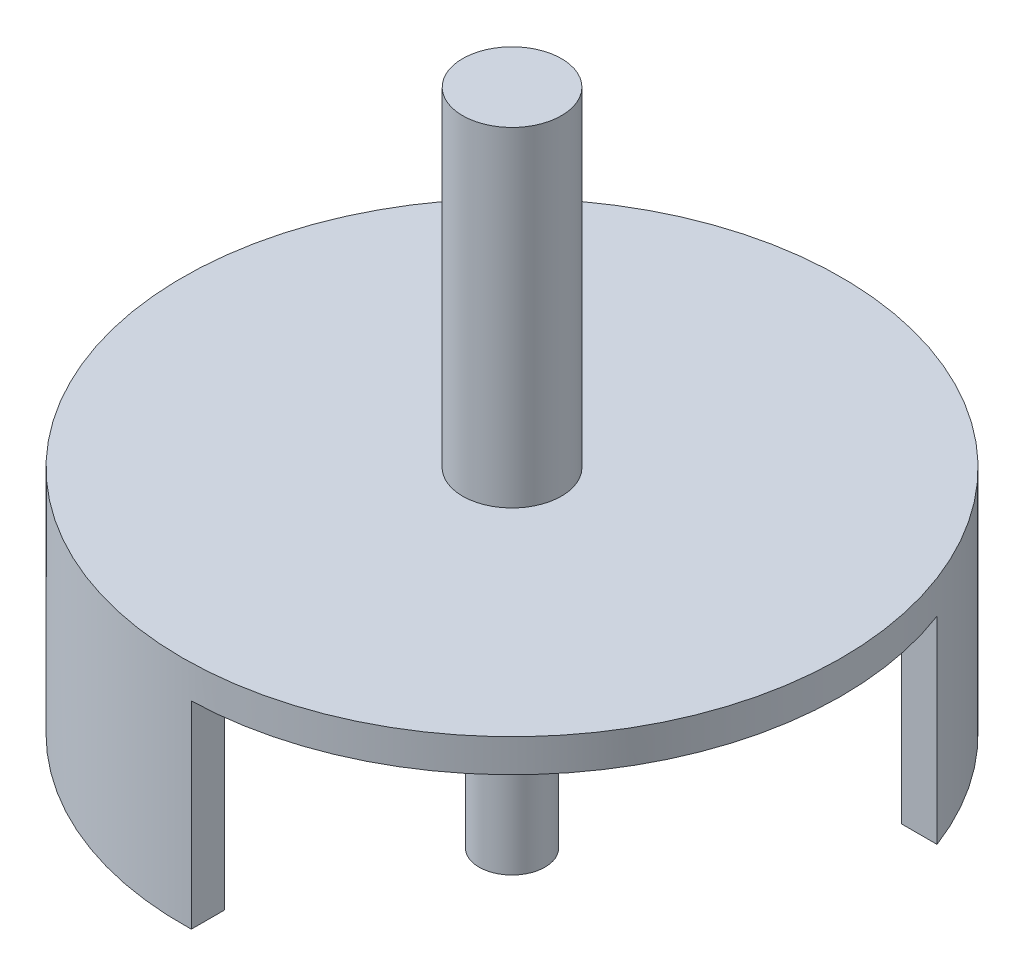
from build123d import *

# Parameters (mm, degrees)
SKETCH1_R           = 10
BOSS_EXTRUDE1_DEPTH = 7
SKETCH2_R           = 9
CUT_EXTRUDE1_DEPTH  = 6
CUT_EXTRUDE5_DEPTH  = 6
SKETCH3_R           = 1
BOSS_EXTRUDE2_DEPTH = 10
SKETCH4_R           = 1.5
BOSS_EXTRUDE3_DEPTH = 10
SKETCH5_W           = 3.283139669
SKETCH5_H           = 4.95402325
CUT_EXTRUDE6_DEPTH  = 6


with BuildPart() as part:
    # Sketch1 → Boss-Extrude1 (new body)
    with BuildSketch(Plane(origin=(0, 0, 0), x_dir=(1, 0, 0), z_dir=(0, 1, 0))):
        with Locations(Location((0, 0, 0), (0, 0, 270))):
            Circle(SKETCH1_R)
    extrude(amount=BOSS_EXTRUDE1_DEPTH)

    # Sketch2 → Cut-Extrude1 (cut)
    with BuildSketch(Plane.XZ):
        with Locations(Location((0, 0, 0), (0, 0, 270))):
            Circle(SKETCH2_R)
    extrude(amount=-CUT_EXTRUDE1_DEPTH, mode=Mode.SUBTRACT)

    # 3DSketch1 → Cut-Extrude5 (cut)
    with BuildSketch(Plane(origin=(11.080596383, 0, 0.322451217), x_dir=(-0.7275050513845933, 0, 0.686102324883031), z_dir=(0, -1, 0))):
        Polygon((0, 0), (8.683802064, -5.832546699), (14.868312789, 0), (7.869256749, 7.421412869), align=None)
    extrude(amount=-CUT_EXTRUDE5_DEPTH, mode=Mode.SUBTRACT)

    # Sketch3 → Boss-Extrude2 (add)
    with BuildSketch(Plane(origin=(0, 7, 0), x_dir=(-1, 0, 0), z_dir=(0, 1, 0))):
        with Locations(Location((0, 0, 0), (0, 0, 90))):
            Circle(SKETCH3_R)
    extrude(amount=-BOSS_EXTRUDE2_DEPTH)

    # Sketch4 → Boss-Extrude3 (add)
    with BuildSketch(Plane(origin=(0, 7, 0), x_dir=(-1, 0, 0), z_dir=(0, 1, 0))):
        with Locations(Location((0, 0, 0), (0, 0, 90))):
            Circle(SKETCH4_R)
    extrude(amount=BOSS_EXTRUDE3_DEPTH)

    # Sketch5 → Cut-Extrude6 (cut)
    with BuildSketch(Plane.XZ):
        with Locations((9.468340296, -1.069951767)):
            Rectangle(SKETCH5_W, SKETCH5_H)
    extrude(amount=-CUT_EXTRUDE6_DEPTH, mode=Mode.SUBTRACT)


solid = part.part
